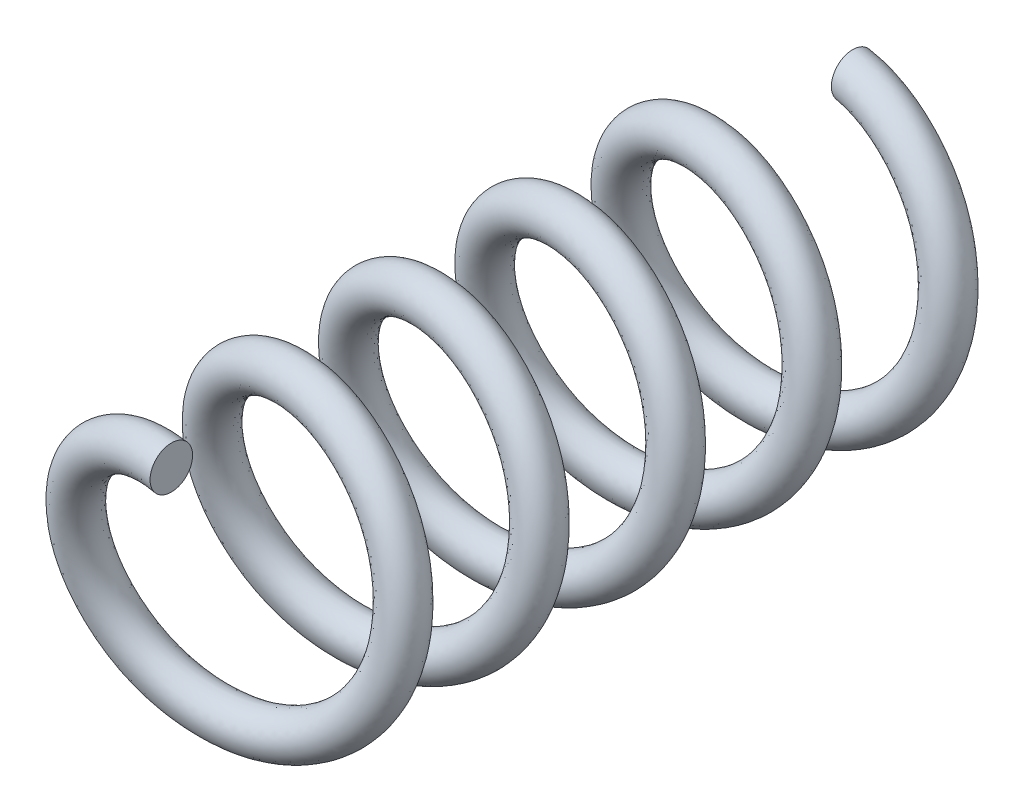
ISO-10303-21;
HEADER;
FILE_DESCRIPTION(('STEP AP214'),'2;1');
FILE_NAME('part.step','',(''),(''),'','','');
FILE_SCHEMA(('AUTOMOTIVE_DESIGN { 1 0 10303 214 1 1 1 1 }'));
ENDSEC;
DATA;
#1=APPLICATION_CONTEXT('core data for automotive mechanical design processes');
#2=APPLICATION_PROTOCOL_DEFINITION('international standard','automotive_design',2000,#1);
#3=PRODUCT_CONTEXT('',#1,'mechanical');
#4=PRODUCT('Part','Part','',(#3));
#5=PRODUCT_RELATED_PRODUCT_CATEGORY('part','',(#4));
#6=PRODUCT_DEFINITION_FORMATION('','',#4);
#7=PRODUCT_DEFINITION_CONTEXT('part definition',#1,'design');
#8=PRODUCT_DEFINITION('design','',#6,#7);
#9=PRODUCT_DEFINITION_SHAPE('','',#8);
#10=(LENGTH_UNIT() NAMED_UNIT(*) SI_UNIT(.MILLI.,.METRE.));
#11=(NAMED_UNIT(*) PLANE_ANGLE_UNIT() SI_UNIT($,.RADIAN.));
#12=(NAMED_UNIT(*) SI_UNIT($,.STERADIAN.) SOLID_ANGLE_UNIT());
#13=UNCERTAINTY_MEASURE_WITH_UNIT(LENGTH_MEASURE(1.E-05),#10,'distance_accuracy_value','');
#14=(GEOMETRIC_REPRESENTATION_CONTEXT(3) GLOBAL_UNCERTAINTY_ASSIGNED_CONTEXT((#13)) GLOBAL_UNIT_ASSIGNED_CONTEXT((#10,
#11,#12)) REPRESENTATION_CONTEXT('',''));
#15=CARTESIAN_POINT('',(0.,0.,0.));
#16=DIRECTION('',(0.,0.,1.));
#17=DIRECTION('',(1.,0.,0.));
#18=AXIS2_PLACEMENT_3D('',#15,#16,#17);
#19=CARTESIAN_POINT('',(0.,9.52499999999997,50.7999999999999));
#20=DIRECTION('',(1.,0.,0.));
#21=DIRECTION('',(0.,0.,-1.));
#22=AXIS2_PLACEMENT_3D('',#19,#20,#21);
#23=PLANE('',#22);
#24=CARTESIAN_POINT('',(5.72228425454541E-13,9.52499999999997,50.7999999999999));
#25=DIRECTION('',(1.,0.,0.));
#26=DIRECTION('',(0.,0.,-1.));
#27=AXIS2_PLACEMENT_3D('',#24,#25,#26);
#28=CIRCLE('',#27,1.5875);
#29=CARTESIAN_POINT('',(2.8611421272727E-13,9.52499999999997,49.2124999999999));
#30=VERTEX_POINT('',#29);
#31=EDGE_CURVE('E41',#30,#30,#28,.T.);
#32=ORIENTED_EDGE('',*,*,#31,.T.);
#33=EDGE_LOOP('',(#32));
#34=FACE_BOUND('',#33,.T.);
#35=ADVANCED_FACE('F31',(#34),#23,.T.);
#36=CARTESIAN_POINT('',(-1.23694015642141E-13,9.52499999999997,0.));
#37=DIRECTION('',(1.,0.,0.));
#38=DIRECTION('',(0.,0.,-1.));
#39=AXIS2_PLACEMENT_3D('',#36,#37,#38);
#40=PLANE('',#39);
#41=CARTESIAN_POINT('',(-1.23694015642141E-13,9.52499999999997,0.));
#42=DIRECTION('',(1.,0.,0.));
#43=DIRECTION('',(0.,0.,-1.));
#44=AXIS2_PLACEMENT_3D('',#41,#42,#43);
#45=CIRCLE('',#44,1.5875);
#46=CARTESIAN_POINT('',(-1.23694015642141E-13,9.52499999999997,-1.5875000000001));
#47=VERTEX_POINT('',#46);
#48=EDGE_CURVE('E11',#47,#47,#45,.T.);
#49=ORIENTED_EDGE('',*,*,#48,.F.);
#50=EDGE_LOOP('',(#49));
#51=FACE_BOUND('',#50,.T.);
#52=ADVANCED_FACE('F49',(#51),#40,.F.);
#53=CARTESIAN_POINT('',(5.72228425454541E-13,9.52499999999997,49.2124999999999));
#54=CARTESIAN_POINT('',(-3.94538418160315,9.52500000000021,48.5774999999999));
#55=CARTESIAN_POINT('',(-6.73519209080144,6.73519209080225,47.9424999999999));
#56=CARTESIAN_POINT('',(-9.52499999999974,3.94538418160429,47.3074999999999));
#57=CARTESIAN_POINT('',(-9.52499999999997,5.72811644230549E-13,46.6724999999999));
#58=CARTESIAN_POINT('',(-9.52500000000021,-3.94538418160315,46.0374999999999));
#59=CARTESIAN_POINT('',(-6.73519209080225,-6.73519209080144,45.4024999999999));
#60=CARTESIAN_POINT('',(-3.94538418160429,-9.52499999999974,44.7674999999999));
#61=CARTESIAN_POINT('',(-5.73394863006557E-13,-9.52499999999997,44.1324999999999));
#62=CARTESIAN_POINT('',(3.94538418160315,-9.52500000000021,43.4974999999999));
#63=CARTESIAN_POINT('',(6.73519209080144,-6.73519209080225,42.8624999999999));
#64=CARTESIAN_POINT('',(9.52499999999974,-3.9453841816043,42.2274999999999));
#65=CARTESIAN_POINT('',(9.52499999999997,-5.73978081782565E-13,41.5924999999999));
#66=CARTESIAN_POINT('',(9.52500000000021,3.94538418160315,40.9574999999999));
#67=CARTESIAN_POINT('',(6.73519209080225,6.73519209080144,40.3224999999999));
#68=CARTESIAN_POINT('',(3.9453841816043,9.52499999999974,39.6874999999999));
#69=CARTESIAN_POINT('',(5.72228425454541E-13,9.52499999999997,39.0524999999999));
#70=CARTESIAN_POINT('',(-3.94538418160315,9.52500000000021,38.4174999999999));
#71=CARTESIAN_POINT('',(-6.73519209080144,6.73519209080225,37.7824999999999));
#72=CARTESIAN_POINT('',(-9.52499999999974,3.94538418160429,37.1474999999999));
#73=CARTESIAN_POINT('',(-9.52499999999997,5.72811644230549E-13,36.5124999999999));
#74=CARTESIAN_POINT('',(-9.52500000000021,-3.94538418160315,35.8774999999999));
#75=CARTESIAN_POINT('',(-6.73519209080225,-6.73519209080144,35.2424999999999));
#76=CARTESIAN_POINT('',(-3.94538418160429,-9.52499999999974,34.6074999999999));
#77=CARTESIAN_POINT('',(-5.73394863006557E-13,-9.52499999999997,33.9724999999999));
#78=CARTESIAN_POINT('',(3.94538418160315,-9.52500000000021,33.3374999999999));
#79=CARTESIAN_POINT('',(6.73519209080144,-6.73519209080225,32.7024999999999));
#80=CARTESIAN_POINT('',(9.52499999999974,-3.9453841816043,32.0674999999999));
#81=CARTESIAN_POINT('',(9.52499999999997,-5.73978081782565E-13,31.4324999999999));
#82=CARTESIAN_POINT('',(9.52500000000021,3.94538418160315,30.7974999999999));
#83=CARTESIAN_POINT('',(6.73519209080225,6.73519209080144,30.1624999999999));
#84=CARTESIAN_POINT('',(3.9453841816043,9.52499999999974,29.5275));
#85=CARTESIAN_POINT('',(5.72228425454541E-13,9.52499999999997,28.8924999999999));
#86=CARTESIAN_POINT('',(-3.94538418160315,9.52500000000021,28.2575));
#87=CARTESIAN_POINT('',(-6.73519209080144,6.73519209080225,27.6225));
#88=CARTESIAN_POINT('',(-9.52499999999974,3.94538418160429,26.9875));
#89=CARTESIAN_POINT('',(-9.52499999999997,5.72811644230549E-13,26.3525));
#90=CARTESIAN_POINT('',(-9.52500000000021,-3.94538418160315,25.7175));
#91=CARTESIAN_POINT('',(-6.73519209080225,-6.73519209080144,25.0825));
#92=CARTESIAN_POINT('',(-3.94538418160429,-9.52499999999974,24.4475));
#93=CARTESIAN_POINT('',(-5.73394863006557E-13,-9.52499999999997,23.8125));
#94=CARTESIAN_POINT('',(3.94538418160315,-9.52500000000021,23.1775));
#95=CARTESIAN_POINT('',(6.73519209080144,-6.73519209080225,22.5425));
#96=CARTESIAN_POINT('',(9.52499999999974,-3.9453841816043,21.9075));
#97=CARTESIAN_POINT('',(9.52499999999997,-5.73978081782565E-13,21.2725));
#98=CARTESIAN_POINT('',(9.52500000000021,3.94538418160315,20.6375));
#99=CARTESIAN_POINT('',(6.73519209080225,6.73519209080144,20.0025));
#100=CARTESIAN_POINT('',(3.9453841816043,9.52499999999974,19.3675));
#101=CARTESIAN_POINT('',(5.72228425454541E-13,9.52499999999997,18.7325));
#102=CARTESIAN_POINT('',(-3.94538418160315,9.52500000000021,18.0975));
#103=CARTESIAN_POINT('',(-6.73519209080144,6.73519209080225,17.4625));
#104=CARTESIAN_POINT('',(-9.52499999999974,3.94538418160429,16.8275));
#105=CARTESIAN_POINT('',(-9.52499999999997,5.72811644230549E-13,16.1925));
#106=CARTESIAN_POINT('',(-9.52500000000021,-3.94538418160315,15.5575));
#107=CARTESIAN_POINT('',(-6.73519209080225,-6.73519209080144,14.9225));
#108=CARTESIAN_POINT('',(-3.94538418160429,-9.52499999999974,14.2875));
#109=CARTESIAN_POINT('',(-5.73394863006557E-13,-9.52499999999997,13.6525));
#110=CARTESIAN_POINT('',(3.94538418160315,-9.52500000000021,13.0175));
#111=CARTESIAN_POINT('',(6.73519209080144,-6.73519209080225,12.3825));
#112=CARTESIAN_POINT('',(9.52499999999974,-3.9453841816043,11.7475));
#113=CARTESIAN_POINT('',(9.52499999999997,-5.73978081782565E-13,11.1125));
#114=CARTESIAN_POINT('',(9.52500000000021,3.94538418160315,10.4775));
#115=CARTESIAN_POINT('',(6.73519209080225,6.73519209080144,9.8425));
#116=CARTESIAN_POINT('',(3.9453841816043,9.52499999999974,9.20749999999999));
#117=CARTESIAN_POINT('',(5.72228425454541E-13,9.52499999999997,8.5725));
#118=CARTESIAN_POINT('',(-3.94538418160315,9.52500000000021,7.9375));
#119=CARTESIAN_POINT('',(-6.73519209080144,6.73519209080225,7.3025));
#120=CARTESIAN_POINT('',(-9.52499999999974,3.94538418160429,6.6675));
#121=CARTESIAN_POINT('',(-9.52499999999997,5.72811644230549E-13,6.0325));
#122=CARTESIAN_POINT('',(-9.52500000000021,-3.94538418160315,5.39750000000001));
#123=CARTESIAN_POINT('',(-6.73519209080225,-6.73519209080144,4.7625));
#124=CARTESIAN_POINT('',(-3.94538418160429,-9.52499999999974,4.12750000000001));
#125=CARTESIAN_POINT('',(-5.73394863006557E-13,-9.52499999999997,3.49250000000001));
#126=CARTESIAN_POINT('',(3.94538418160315,-9.52500000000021,2.85750000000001));
#127=CARTESIAN_POINT('',(6.73519209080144,-6.73519209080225,2.22250000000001));
#128=CARTESIAN_POINT('',(9.52499999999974,-3.9453841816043,1.58750000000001));
#129=CARTESIAN_POINT('',(9.52499999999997,-5.73978081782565E-13,0.952500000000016));
#130=CARTESIAN_POINT('',(9.52500000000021,3.94538418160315,0.317500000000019));
#131=CARTESIAN_POINT('',(6.73519209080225,6.73519209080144,-0.317499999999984));
#132=CARTESIAN_POINT('',(3.9453841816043,9.52499999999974,-0.952499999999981));
#133=CARTESIAN_POINT('',(5.72228425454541E-13,9.52499999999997,-1.58749999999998));
#134=CARTESIAN_POINT('',(7.62971233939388E-13,12.7,49.2124999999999));
#135=CARTESIAN_POINT('',(-5.26051224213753,12.7000000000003,48.5774999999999));
#136=CARTESIAN_POINT('',(-8.98025612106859,8.98025612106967,47.9424999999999));
#137=CARTESIAN_POINT('',(-12.6999999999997,5.26051224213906,47.3074999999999));
#138=CARTESIAN_POINT('',(-12.7,7.63748858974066E-13,46.6724999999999));
#139=CARTESIAN_POINT('',(-12.7000000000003,-5.26051224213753,46.0374999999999));
#140=CARTESIAN_POINT('',(-8.98025612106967,-8.98025612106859,45.4024999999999));
#141=CARTESIAN_POINT('',(-5.26051224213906,-12.6999999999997,44.7674999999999));
#142=CARTESIAN_POINT('',(-7.64526484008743E-13,-12.7,44.1324999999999));
#143=CARTESIAN_POINT('',(5.26051224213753,-12.7000000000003,43.4974999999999));
#144=CARTESIAN_POINT('',(8.98025612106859,-8.98025612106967,42.8624999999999));
#145=CARTESIAN_POINT('',(12.6999999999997,-5.26051224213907,42.2274999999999));
#146=CARTESIAN_POINT('',(12.7,-7.6530410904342E-13,41.5924999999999));
#147=CARTESIAN_POINT('',(12.7000000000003,5.26051224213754,40.9574999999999));
#148=CARTESIAN_POINT('',(8.98025612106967,8.98025612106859,40.3224999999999));
#149=CARTESIAN_POINT('',(5.26051224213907,12.6999999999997,39.6874999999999));
#150=CARTESIAN_POINT('',(7.62971233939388E-13,12.7,39.0524999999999));
#151=CARTESIAN_POINT('',(-5.26051224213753,12.7000000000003,38.4174999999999));
#152=CARTESIAN_POINT('',(-8.98025612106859,8.98025612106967,37.7824999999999));
#153=CARTESIAN_POINT('',(-12.6999999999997,5.26051224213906,37.1474999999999));
#154=CARTESIAN_POINT('',(-12.7,7.63748858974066E-13,36.5124999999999));
#155=CARTESIAN_POINT('',(-12.7000000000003,-5.26051224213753,35.8774999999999));
#156=CARTESIAN_POINT('',(-8.98025612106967,-8.98025612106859,35.2424999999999));
#157=CARTESIAN_POINT('',(-5.26051224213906,-12.6999999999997,34.6074999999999));
#158=CARTESIAN_POINT('',(-7.64526484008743E-13,-12.7,33.9724999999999));
#159=CARTESIAN_POINT('',(5.26051224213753,-12.7000000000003,33.3374999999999));
#160=CARTESIAN_POINT('',(8.98025612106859,-8.98025612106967,32.7024999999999));
#161=CARTESIAN_POINT('',(12.6999999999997,-5.26051224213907,32.0674999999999));
#162=CARTESIAN_POINT('',(12.7,-7.6530410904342E-13,31.4324999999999));
#163=CARTESIAN_POINT('',(12.7000000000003,5.26051224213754,30.7974999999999));
#164=CARTESIAN_POINT('',(8.98025612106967,8.98025612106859,30.1624999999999));
#165=CARTESIAN_POINT('',(5.26051224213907,12.6999999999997,29.5275));
#166=CARTESIAN_POINT('',(7.62971233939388E-13,12.7,28.8924999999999));
#167=CARTESIAN_POINT('',(-5.26051224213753,12.7000000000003,28.2574999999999));
#168=CARTESIAN_POINT('',(-8.98025612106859,8.98025612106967,27.6225));
#169=CARTESIAN_POINT('',(-12.6999999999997,5.26051224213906,26.9875));
#170=CARTESIAN_POINT('',(-12.7,7.63748858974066E-13,26.3525));
#171=CARTESIAN_POINT('',(-12.7000000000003,-5.26051224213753,25.7175));
#172=CARTESIAN_POINT('',(-8.98025612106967,-8.98025612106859,25.0825));
#173=CARTESIAN_POINT('',(-5.26051224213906,-12.6999999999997,24.4475));
#174=CARTESIAN_POINT('',(-7.64526484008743E-13,-12.7,23.8125));
#175=CARTESIAN_POINT('',(5.26051224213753,-12.7000000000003,23.1775));
#176=CARTESIAN_POINT('',(8.98025612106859,-8.98025612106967,22.5425));
#177=CARTESIAN_POINT('',(12.6999999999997,-5.26051224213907,21.9075));
#178=CARTESIAN_POINT('',(12.7,-7.6530410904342E-13,21.2725));
#179=CARTESIAN_POINT('',(12.7000000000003,5.26051224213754,20.6375));
#180=CARTESIAN_POINT('',(8.98025612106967,8.98025612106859,20.0025));
#181=CARTESIAN_POINT('',(5.26051224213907,12.6999999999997,19.3675));
#182=CARTESIAN_POINT('',(7.62971233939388E-13,12.7,18.7325));
#183=CARTESIAN_POINT('',(-5.26051224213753,12.7000000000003,18.0975));
#184=CARTESIAN_POINT('',(-8.98025612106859,8.98025612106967,17.4625));
#185=CARTESIAN_POINT('',(-12.6999999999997,5.26051224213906,16.8275));
#186=CARTESIAN_POINT('',(-12.7,7.63748858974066E-13,16.1925));
#187=CARTESIAN_POINT('',(-12.7000000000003,-5.26051224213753,15.5575));
#188=CARTESIAN_POINT('',(-8.98025612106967,-8.98025612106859,14.9225));
#189=CARTESIAN_POINT('',(-5.26051224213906,-12.6999999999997,14.2875));
#190=CARTESIAN_POINT('',(-7.64526484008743E-13,-12.7,13.6525));
#191=CARTESIAN_POINT('',(5.26051224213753,-12.7000000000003,13.0175));
#192=CARTESIAN_POINT('',(8.98025612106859,-8.98025612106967,12.3825));
#193=CARTESIAN_POINT('',(12.6999999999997,-5.26051224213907,11.7475));
#194=CARTESIAN_POINT('',(12.7,-7.6530410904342E-13,11.1125));
#195=CARTESIAN_POINT('',(12.7000000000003,5.26051224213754,10.4775));
#196=CARTESIAN_POINT('',(8.98025612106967,8.98025612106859,9.8425));
#197=CARTESIAN_POINT('',(5.26051224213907,12.6999999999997,9.20749999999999));
#198=CARTESIAN_POINT('',(7.62971233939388E-13,12.7,8.5725));
#199=CARTESIAN_POINT('',(-5.26051224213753,12.7000000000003,7.9375));
#200=CARTESIAN_POINT('',(-8.98025612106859,8.98025612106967,7.3025));
#201=CARTESIAN_POINT('',(-12.6999999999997,5.26051224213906,6.6675));
#202=CARTESIAN_POINT('',(-12.7,7.63748858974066E-13,6.0325));
#203=CARTESIAN_POINT('',(-12.7000000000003,-5.26051224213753,5.39750000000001));
#204=CARTESIAN_POINT('',(-8.98025612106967,-8.98025612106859,4.7625));
#205=CARTESIAN_POINT('',(-5.26051224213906,-12.6999999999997,4.12750000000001));
#206=CARTESIAN_POINT('',(-7.64526484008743E-13,-12.7,3.49250000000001));
#207=CARTESIAN_POINT('',(5.26051224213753,-12.7000000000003,2.85750000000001));
#208=CARTESIAN_POINT('',(8.98025612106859,-8.98025612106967,2.22250000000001));
#209=CARTESIAN_POINT('',(12.6999999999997,-5.26051224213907,1.58750000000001));
#210=CARTESIAN_POINT('',(12.7,-7.6530410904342E-13,0.952500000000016));
#211=CARTESIAN_POINT('',(12.7000000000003,5.26051224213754,0.317500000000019));
#212=CARTESIAN_POINT('',(8.98025612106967,8.98025612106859,-0.317499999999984));
#213=CARTESIAN_POINT('',(5.26051224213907,12.6999999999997,-0.952499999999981));
#214=CARTESIAN_POINT('',(7.62971233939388E-13,12.7,-1.58749999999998));
#215=CARTESIAN_POINT('',(7.62971233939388E-13,12.7,52.3874999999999));
#216=CARTESIAN_POINT('',(-5.26051224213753,12.7000000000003,51.7524999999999));
#217=CARTESIAN_POINT('',(-8.98025612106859,8.98025612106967,51.1174999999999));
#218=CARTESIAN_POINT('',(-12.6999999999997,5.26051224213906,50.4824999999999));
#219=CARTESIAN_POINT('',(-12.7,7.63748858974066E-13,49.8474999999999));
#220=CARTESIAN_POINT('',(-12.7000000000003,-5.26051224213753,49.2124999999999));
#221=CARTESIAN_POINT('',(-8.98025612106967,-8.98025612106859,48.5774999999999));
#222=CARTESIAN_POINT('',(-5.26051224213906,-12.6999999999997,47.9424999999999));
#223=CARTESIAN_POINT('',(-7.64526484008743E-13,-12.7,47.3074999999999));
#224=CARTESIAN_POINT('',(5.26051224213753,-12.7000000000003,46.6724999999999));
#225=CARTESIAN_POINT('',(8.98025612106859,-8.98025612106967,46.0374999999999));
#226=CARTESIAN_POINT('',(12.6999999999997,-5.26051224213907,45.4024999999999));
#227=CARTESIAN_POINT('',(12.7,-7.6530410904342E-13,44.7674999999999));
#228=CARTESIAN_POINT('',(12.7000000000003,5.26051224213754,44.1324999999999));
#229=CARTESIAN_POINT('',(8.98025612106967,8.98025612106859,43.4974999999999));
#230=CARTESIAN_POINT('',(5.26051224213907,12.6999999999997,42.8624999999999));
#231=CARTESIAN_POINT('',(7.62971233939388E-13,12.7,42.2274999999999));
#232=CARTESIAN_POINT('',(-5.26051224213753,12.7000000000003,41.5924999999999));
#233=CARTESIAN_POINT('',(-8.98025612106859,8.98025612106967,40.9574999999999));
#234=CARTESIAN_POINT('',(-12.6999999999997,5.26051224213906,40.3224999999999));
#235=CARTESIAN_POINT('',(-12.7,7.63748858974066E-13,39.6874999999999));
#236=CARTESIAN_POINT('',(-12.7000000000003,-5.26051224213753,39.0524999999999));
#237=CARTESIAN_POINT('',(-8.98025612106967,-8.98025612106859,38.4174999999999));
#238=CARTESIAN_POINT('',(-5.26051224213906,-12.6999999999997,37.7824999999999));
#239=CARTESIAN_POINT('',(-7.64526484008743E-13,-12.7,37.1474999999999));
#240=CARTESIAN_POINT('',(5.26051224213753,-12.7000000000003,36.5124999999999));
#241=CARTESIAN_POINT('',(8.98025612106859,-8.98025612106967,35.8774999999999));
#242=CARTESIAN_POINT('',(12.6999999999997,-5.26051224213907,35.2424999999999));
#243=CARTESIAN_POINT('',(12.7,-7.6530410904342E-13,34.6074999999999));
#244=CARTESIAN_POINT('',(12.7000000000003,5.26051224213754,33.9724999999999));
#245=CARTESIAN_POINT('',(8.98025612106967,8.98025612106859,33.3374999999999));
#246=CARTESIAN_POINT('',(5.26051224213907,12.6999999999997,32.7024999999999));
#247=CARTESIAN_POINT('',(7.62971233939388E-13,12.7,32.0674999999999));
#248=CARTESIAN_POINT('',(-5.26051224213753,12.7000000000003,31.4324999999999));
#249=CARTESIAN_POINT('',(-8.98025612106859,8.98025612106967,30.7974999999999));
#250=CARTESIAN_POINT('',(-12.6999999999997,5.26051224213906,30.1624999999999));
#251=CARTESIAN_POINT('',(-12.7,7.63748858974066E-13,29.5274999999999));
#252=CARTESIAN_POINT('',(-12.7000000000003,-5.26051224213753,28.8924999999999));
#253=CARTESIAN_POINT('',(-8.98025612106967,-8.98025612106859,28.2575));
#254=CARTESIAN_POINT('',(-5.26051224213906,-12.6999999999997,27.6225));
#255=CARTESIAN_POINT('',(-7.64526484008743E-13,-12.7,26.9875));
#256=CARTESIAN_POINT('',(5.26051224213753,-12.7000000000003,26.3525));
#257=CARTESIAN_POINT('',(8.98025612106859,-8.98025612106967,25.7175));
#258=CARTESIAN_POINT('',(12.6999999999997,-5.26051224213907,25.0825));
#259=CARTESIAN_POINT('',(12.7,-7.6530410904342E-13,24.4475));
#260=CARTESIAN_POINT('',(12.7000000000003,5.26051224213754,23.8125));
#261=CARTESIAN_POINT('',(8.98025612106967,8.98025612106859,23.1775));
#262=CARTESIAN_POINT('',(5.26051224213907,12.6999999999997,22.5425));
#263=CARTESIAN_POINT('',(7.62971233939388E-13,12.7,21.9075));
#264=CARTESIAN_POINT('',(-5.26051224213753,12.7000000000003,21.2725));
#265=CARTESIAN_POINT('',(-8.98025612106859,8.98025612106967,20.6375));
#266=CARTESIAN_POINT('',(-12.6999999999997,5.26051224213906,20.0025));
#267=CARTESIAN_POINT('',(-12.7,7.63748858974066E-13,19.3675));
#268=CARTESIAN_POINT('',(-12.7000000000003,-5.26051224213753,18.7325));
#269=CARTESIAN_POINT('',(-8.98025612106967,-8.98025612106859,18.0975));
#270=CARTESIAN_POINT('',(-5.26051224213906,-12.6999999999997,17.4625));
#271=CARTESIAN_POINT('',(-7.64526484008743E-13,-12.7,16.8275));
#272=CARTESIAN_POINT('',(5.26051224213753,-12.7000000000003,16.1925));
#273=CARTESIAN_POINT('',(8.98025612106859,-8.98025612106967,15.5575));
#274=CARTESIAN_POINT('',(12.6999999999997,-5.26051224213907,14.9225));
#275=CARTESIAN_POINT('',(12.7,-7.6530410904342E-13,14.2875));
#276=CARTESIAN_POINT('',(12.7000000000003,5.26051224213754,13.6525));
#277=CARTESIAN_POINT('',(8.98025612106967,8.98025612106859,13.0175));
#278=CARTESIAN_POINT('',(5.26051224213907,12.6999999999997,12.3825));
#279=CARTESIAN_POINT('',(7.62971233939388E-13,12.7,11.7475));
#280=CARTESIAN_POINT('',(-5.26051224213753,12.7000000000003,11.1125));
#281=CARTESIAN_POINT('',(-8.98025612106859,8.98025612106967,10.4775));
#282=CARTESIAN_POINT('',(-12.6999999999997,5.26051224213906,9.84249999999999));
#283=CARTESIAN_POINT('',(-12.7,7.63748858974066E-13,9.20749999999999));
#284=CARTESIAN_POINT('',(-12.7000000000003,-5.26051224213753,8.5725));
#285=CARTESIAN_POINT('',(-8.98025612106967,-8.98025612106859,7.93749999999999));
#286=CARTESIAN_POINT('',(-5.26051224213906,-12.6999999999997,7.3025));
#287=CARTESIAN_POINT('',(-7.64526484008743E-13,-12.7,6.6675));
#288=CARTESIAN_POINT('',(5.26051224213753,-12.7000000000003,6.0325));
#289=CARTESIAN_POINT('',(8.98025612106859,-8.98025612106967,5.3975));
#290=CARTESIAN_POINT('',(12.6999999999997,-5.26051224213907,4.7625));
#291=CARTESIAN_POINT('',(12.7,-7.6530410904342E-13,4.12750000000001));
#292=CARTESIAN_POINT('',(12.7000000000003,5.26051224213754,3.49250000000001));
#293=CARTESIAN_POINT('',(8.98025612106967,8.98025612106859,2.85750000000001));
#294=CARTESIAN_POINT('',(5.26051224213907,12.6999999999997,2.22250000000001));
#295=CARTESIAN_POINT('',(7.62971233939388E-13,12.7,1.58750000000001));
#296=CARTESIAN_POINT('',(5.72228425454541E-13,9.52499999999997,52.3874999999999));
#297=CARTESIAN_POINT('',(-3.94538418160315,9.52500000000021,51.7524999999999));
#298=CARTESIAN_POINT('',(-6.73519209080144,6.73519209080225,51.1174999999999));
#299=CARTESIAN_POINT('',(-9.52499999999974,3.94538418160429,50.4824999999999));
#300=CARTESIAN_POINT('',(-9.52499999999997,5.72811644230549E-13,49.8474999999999));
#301=CARTESIAN_POINT('',(-9.52500000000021,-3.94538418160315,49.2124999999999));
#302=CARTESIAN_POINT('',(-6.73519209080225,-6.73519209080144,48.5774999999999));
#303=CARTESIAN_POINT('',(-3.94538418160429,-9.52499999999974,47.9424999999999));
#304=CARTESIAN_POINT('',(-5.73394863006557E-13,-9.52499999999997,47.3074999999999));
#305=CARTESIAN_POINT('',(3.94538418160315,-9.52500000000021,46.6724999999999));
#306=CARTESIAN_POINT('',(6.73519209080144,-6.73519209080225,46.0374999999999));
#307=CARTESIAN_POINT('',(9.52499999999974,-3.9453841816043,45.4024999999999));
#308=CARTESIAN_POINT('',(9.52499999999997,-5.73978081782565E-13,44.7674999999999));
#309=CARTESIAN_POINT('',(9.52500000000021,3.94538418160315,44.1324999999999));
#310=CARTESIAN_POINT('',(6.73519209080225,6.73519209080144,43.4974999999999));
#311=CARTESIAN_POINT('',(3.9453841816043,9.52499999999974,42.8624999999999));
#312=CARTESIAN_POINT('',(5.72228425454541E-13,9.52499999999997,42.2274999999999));
#313=CARTESIAN_POINT('',(-3.94538418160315,9.52500000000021,41.5924999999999));
#314=CARTESIAN_POINT('',(-6.73519209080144,6.73519209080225,40.9574999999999));
#315=CARTESIAN_POINT('',(-9.52499999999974,3.94538418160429,40.3224999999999));
#316=CARTESIAN_POINT('',(-9.52499999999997,5.72811644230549E-13,39.6874999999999));
#317=CARTESIAN_POINT('',(-9.52500000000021,-3.94538418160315,39.0524999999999));
#318=CARTESIAN_POINT('',(-6.73519209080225,-6.73519209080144,38.4174999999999));
#319=CARTESIAN_POINT('',(-3.94538418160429,-9.52499999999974,37.7824999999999));
#320=CARTESIAN_POINT('',(-5.73394863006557E-13,-9.52499999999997,37.1474999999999));
#321=CARTESIAN_POINT('',(3.94538418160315,-9.52500000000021,36.5124999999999));
#322=CARTESIAN_POINT('',(6.73519209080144,-6.73519209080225,35.8774999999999));
#323=CARTESIAN_POINT('',(9.52499999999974,-3.9453841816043,35.2424999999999));
#324=CARTESIAN_POINT('',(9.52499999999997,-5.73978081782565E-13,34.6074999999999));
#325=CARTESIAN_POINT('',(9.52500000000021,3.94538418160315,33.9724999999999));
#326=CARTESIAN_POINT('',(6.73519209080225,6.73519209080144,33.3374999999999));
#327=CARTESIAN_POINT('',(3.9453841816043,9.52499999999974,32.7024999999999));
#328=CARTESIAN_POINT('',(5.72228425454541E-13,9.52499999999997,32.0674999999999));
#329=CARTESIAN_POINT('',(-3.94538418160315,9.52500000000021,31.4324999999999));
#330=CARTESIAN_POINT('',(-6.73519209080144,6.73519209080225,30.7974999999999));
#331=CARTESIAN_POINT('',(-9.52499999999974,3.94538418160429,30.1624999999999));
#332=CARTESIAN_POINT('',(-9.52499999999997,5.72811644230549E-13,29.5275));
#333=CARTESIAN_POINT('',(-9.52500000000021,-3.94538418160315,28.8925));
#334=CARTESIAN_POINT('',(-6.73519209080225,-6.73519209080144,28.2575));
#335=CARTESIAN_POINT('',(-3.94538418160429,-9.52499999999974,27.6225));
#336=CARTESIAN_POINT('',(-5.73394863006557E-13,-9.52499999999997,26.9875));
#337=CARTESIAN_POINT('',(3.94538418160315,-9.52500000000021,26.3525));
#338=CARTESIAN_POINT('',(6.73519209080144,-6.73519209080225,25.7175));
#339=CARTESIAN_POINT('',(9.52499999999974,-3.9453841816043,25.0825));
#340=CARTESIAN_POINT('',(9.52499999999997,-5.73978081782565E-13,24.4475));
#341=CARTESIAN_POINT('',(9.52500000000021,3.94538418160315,23.8125));
#342=CARTESIAN_POINT('',(6.73519209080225,6.73519209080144,23.1775));
#343=CARTESIAN_POINT('',(3.9453841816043,9.52499999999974,22.5425));
#344=CARTESIAN_POINT('',(5.72228425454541E-13,9.52499999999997,21.9075));
#345=CARTESIAN_POINT('',(-3.94538418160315,9.52500000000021,21.2725));
#346=CARTESIAN_POINT('',(-6.73519209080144,6.73519209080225,20.6375));
#347=CARTESIAN_POINT('',(-9.52499999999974,3.94538418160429,20.0025));
#348=CARTESIAN_POINT('',(-9.52499999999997,5.72811644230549E-13,19.3675));
#349=CARTESIAN_POINT('',(-9.52500000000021,-3.94538418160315,18.7325));
#350=CARTESIAN_POINT('',(-6.73519209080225,-6.73519209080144,18.0975));
#351=CARTESIAN_POINT('',(-3.94538418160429,-9.52499999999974,17.4625));
#352=CARTESIAN_POINT('',(-5.73394863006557E-13,-9.52499999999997,16.8275));
#353=CARTESIAN_POINT('',(3.94538418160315,-9.52500000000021,16.1925));
#354=CARTESIAN_POINT('',(6.73519209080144,-6.73519209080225,15.5575));
#355=CARTESIAN_POINT('',(9.52499999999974,-3.9453841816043,14.9225));
#356=CARTESIAN_POINT('',(9.52499999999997,-5.73978081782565E-13,14.2875));
#357=CARTESIAN_POINT('',(9.52500000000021,3.94538418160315,13.6525));
#358=CARTESIAN_POINT('',(6.73519209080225,6.73519209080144,13.0175));
#359=CARTESIAN_POINT('',(3.9453841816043,9.52499999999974,12.3825));
#360=CARTESIAN_POINT('',(5.72228425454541E-13,9.52499999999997,11.7475));
#361=CARTESIAN_POINT('',(-3.94538418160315,9.52500000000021,11.1125));
#362=CARTESIAN_POINT('',(-6.73519209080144,6.73519209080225,10.4775));
#363=CARTESIAN_POINT('',(-9.52499999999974,3.94538418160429,9.8425));
#364=CARTESIAN_POINT('',(-9.52499999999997,5.72811644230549E-13,9.2075));
#365=CARTESIAN_POINT('',(-9.52500000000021,-3.94538418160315,8.5725));
#366=CARTESIAN_POINT('',(-6.73519209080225,-6.73519209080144,7.9375));
#367=CARTESIAN_POINT('',(-3.94538418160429,-9.52499999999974,7.3025));
#368=CARTESIAN_POINT('',(-5.73394863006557E-13,-9.52499999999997,6.66750000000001));
#369=CARTESIAN_POINT('',(3.94538418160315,-9.52500000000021,6.03250000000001));
#370=CARTESIAN_POINT('',(6.73519209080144,-6.73519209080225,5.39750000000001));
#371=CARTESIAN_POINT('',(9.52499999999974,-3.9453841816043,4.76250000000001));
#372=CARTESIAN_POINT('',(9.52499999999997,-5.73978081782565E-13,4.12750000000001));
#373=CARTESIAN_POINT('',(9.52500000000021,3.94538418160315,3.49250000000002));
#374=CARTESIAN_POINT('',(6.73519209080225,6.73519209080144,2.85750000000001));
#375=CARTESIAN_POINT('',(3.9453841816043,9.52499999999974,2.22250000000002));
#376=CARTESIAN_POINT('',(5.72228425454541E-13,9.52499999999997,1.58750000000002));
#377=CARTESIAN_POINT('',(3.81485616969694E-13,6.34999999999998,52.3874999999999));
#378=CARTESIAN_POINT('',(-2.63025612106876,6.35000000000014,51.7524999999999));
#379=CARTESIAN_POINT('',(-4.49012806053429,4.49012806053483,51.1174999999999));
#380=CARTESIAN_POINT('',(-6.34999999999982,2.63025612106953,50.4824999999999));
#381=CARTESIAN_POINT('',(-6.34999999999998,3.81874429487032E-13,49.8474999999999));
#382=CARTESIAN_POINT('',(-6.35000000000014,-2.63025612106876,49.2124999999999));
#383=CARTESIAN_POINT('',(-4.49012806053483,-4.49012806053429,48.5774999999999));
#384=CARTESIAN_POINT('',(-2.63025612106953,-6.34999999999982,47.9424999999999));
#385=CARTESIAN_POINT('',(-3.82263242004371E-13,-6.34999999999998,47.3074999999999));
#386=CARTESIAN_POINT('',(2.63025612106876,-6.35000000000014,46.6724999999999));
#387=CARTESIAN_POINT('',(4.49012806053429,-4.49012806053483,46.0374999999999));
#388=CARTESIAN_POINT('',(6.34999999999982,-2.63025612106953,45.4024999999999));
#389=CARTESIAN_POINT('',(6.34999999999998,-3.82652054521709E-13,44.7674999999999));
#390=CARTESIAN_POINT('',(6.35000000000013,2.63025612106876,44.1324999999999));
#391=CARTESIAN_POINT('',(4.49012806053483,4.49012806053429,43.4974999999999));
#392=CARTESIAN_POINT('',(2.63025612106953,6.34999999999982,42.8624999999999));
#393=CARTESIAN_POINT('',(3.81485616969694E-13,6.34999999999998,42.2274999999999));
#394=CARTESIAN_POINT('',(-2.63025612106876,6.35000000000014,41.5924999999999));
#395=CARTESIAN_POINT('',(-4.49012806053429,4.49012806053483,40.9574999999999));
#396=CARTESIAN_POINT('',(-6.34999999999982,2.63025612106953,40.3224999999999));
#397=CARTESIAN_POINT('',(-6.34999999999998,3.81874429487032E-13,39.6874999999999));
#398=CARTESIAN_POINT('',(-6.35000000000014,-2.63025612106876,39.0524999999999));
#399=CARTESIAN_POINT('',(-4.49012806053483,-4.49012806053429,38.4174999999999));
#400=CARTESIAN_POINT('',(-2.63025612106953,-6.34999999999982,37.7824999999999));
#401=CARTESIAN_POINT('',(-3.82263242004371E-13,-6.34999999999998,37.1474999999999));
#402=CARTESIAN_POINT('',(2.63025612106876,-6.35000000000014,36.5124999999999));
#403=CARTESIAN_POINT('',(4.49012806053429,-4.49012806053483,35.8774999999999));
#404=CARTESIAN_POINT('',(6.34999999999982,-2.63025612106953,35.2424999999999));
#405=CARTESIAN_POINT('',(6.34999999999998,-3.82652054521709E-13,34.6074999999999));
#406=CARTESIAN_POINT('',(6.35000000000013,2.63025612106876,33.9724999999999));
#407=CARTESIAN_POINT('',(4.49012806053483,4.49012806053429,33.3374999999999));
#408=CARTESIAN_POINT('',(2.63025612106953,6.34999999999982,32.7024999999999));
#409=CARTESIAN_POINT('',(3.81485616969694E-13,6.34999999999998,32.0674999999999));
#410=CARTESIAN_POINT('',(-2.63025612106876,6.35000000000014,31.4324999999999));
#411=CARTESIAN_POINT('',(-4.49012806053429,4.49012806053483,30.7974999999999));
#412=CARTESIAN_POINT('',(-6.34999999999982,2.63025612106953,30.1624999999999));
#413=CARTESIAN_POINT('',(-6.34999999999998,3.81874429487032E-13,29.5274999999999));
#414=CARTESIAN_POINT('',(-6.35000000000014,-2.63025612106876,28.8924999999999));
#415=CARTESIAN_POINT('',(-4.49012806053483,-4.49012806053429,28.2575));
#416=CARTESIAN_POINT('',(-2.63025612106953,-6.34999999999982,27.6225));
#417=CARTESIAN_POINT('',(-3.82263242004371E-13,-6.34999999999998,26.9875));
#418=CARTESIAN_POINT('',(2.63025612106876,-6.35000000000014,26.3525));
#419=CARTESIAN_POINT('',(4.49012806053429,-4.49012806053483,25.7175));
#420=CARTESIAN_POINT('',(6.34999999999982,-2.63025612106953,25.0825));
#421=CARTESIAN_POINT('',(6.34999999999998,-3.82652054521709E-13,24.4475));
#422=CARTESIAN_POINT('',(6.35000000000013,2.63025612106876,23.8125));
#423=CARTESIAN_POINT('',(4.49012806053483,4.49012806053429,23.1775));
#424=CARTESIAN_POINT('',(2.63025612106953,6.34999999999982,22.5425));
#425=CARTESIAN_POINT('',(3.81485616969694E-13,6.34999999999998,21.9075));
#426=CARTESIAN_POINT('',(-2.63025612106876,6.35000000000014,21.2725));
#427=CARTESIAN_POINT('',(-4.49012806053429,4.49012806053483,20.6375));
#428=CARTESIAN_POINT('',(-6.34999999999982,2.63025612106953,20.0025));
#429=CARTESIAN_POINT('',(-6.34999999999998,3.81874429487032E-13,19.3675));
#430=CARTESIAN_POINT('',(-6.35000000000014,-2.63025612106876,18.7325));
#431=CARTESIAN_POINT('',(-4.49012806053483,-4.49012806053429,18.0975));
#432=CARTESIAN_POINT('',(-2.63025612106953,-6.34999999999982,17.4625));
#433=CARTESIAN_POINT('',(-3.82263242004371E-13,-6.34999999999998,16.8275));
#434=CARTESIAN_POINT('',(2.63025612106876,-6.35000000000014,16.1925));
#435=CARTESIAN_POINT('',(4.49012806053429,-4.49012806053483,15.5575));
#436=CARTESIAN_POINT('',(6.34999999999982,-2.63025612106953,14.9225));
#437=CARTESIAN_POINT('',(6.34999999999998,-3.82652054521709E-13,14.2875));
#438=CARTESIAN_POINT('',(6.35000000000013,2.63025612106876,13.6525));
#439=CARTESIAN_POINT('',(4.49012806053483,4.49012806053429,13.0175));
#440=CARTESIAN_POINT('',(2.63025612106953,6.34999999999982,12.3825));
#441=CARTESIAN_POINT('',(3.81485616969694E-13,6.34999999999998,11.7475));
#442=CARTESIAN_POINT('',(-2.63025612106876,6.35000000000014,11.1125));
#443=CARTESIAN_POINT('',(-4.49012806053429,4.49012806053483,10.4775));
#444=CARTESIAN_POINT('',(-6.34999999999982,2.63025612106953,9.84249999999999));
#445=CARTESIAN_POINT('',(-6.34999999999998,3.81874429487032E-13,9.20749999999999));
#446=CARTESIAN_POINT('',(-6.35000000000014,-2.63025612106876,8.5725));
#447=CARTESIAN_POINT('',(-4.49012806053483,-4.49012806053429,7.93749999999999));
#448=CARTESIAN_POINT('',(-2.63025612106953,-6.34999999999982,7.3025));
#449=CARTESIAN_POINT('',(-3.82263242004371E-13,-6.34999999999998,6.6675));
#450=CARTESIAN_POINT('',(2.63025612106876,-6.35000000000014,6.0325));
#451=CARTESIAN_POINT('',(4.49012806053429,-4.49012806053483,5.3975));
#452=CARTESIAN_POINT('',(6.34999999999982,-2.63025612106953,4.7625));
#453=CARTESIAN_POINT('',(6.34999999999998,-3.82652054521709E-13,4.12750000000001));
#454=CARTESIAN_POINT('',(6.35000000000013,2.63025612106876,3.49250000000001));
#455=CARTESIAN_POINT('',(4.49012806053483,4.49012806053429,2.85750000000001));
#456=CARTESIAN_POINT('',(2.63025612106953,6.34999999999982,2.22250000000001));
#457=CARTESIAN_POINT('',(3.81485616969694E-13,6.34999999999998,1.58750000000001));
#458=CARTESIAN_POINT('',(3.81485616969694E-13,6.34999999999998,49.2124999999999));
#459=CARTESIAN_POINT('',(-2.63025612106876,6.35000000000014,48.5774999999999));
#460=CARTESIAN_POINT('',(-4.49012806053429,4.49012806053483,47.9424999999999));
#461=CARTESIAN_POINT('',(-6.34999999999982,2.63025612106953,47.3074999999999));
#462=CARTESIAN_POINT('',(-6.34999999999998,3.81874429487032E-13,46.6724999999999));
#463=CARTESIAN_POINT('',(-6.35000000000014,-2.63025612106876,46.0374999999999));
#464=CARTESIAN_POINT('',(-4.49012806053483,-4.49012806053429,45.4024999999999));
#465=CARTESIAN_POINT('',(-2.63025612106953,-6.34999999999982,44.7674999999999));
#466=CARTESIAN_POINT('',(-3.82263242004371E-13,-6.34999999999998,44.1324999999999));
#467=CARTESIAN_POINT('',(2.63025612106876,-6.35000000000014,43.4974999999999));
#468=CARTESIAN_POINT('',(4.49012806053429,-4.49012806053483,42.8624999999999));
#469=CARTESIAN_POINT('',(6.34999999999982,-2.63025612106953,42.2274999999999));
#470=CARTESIAN_POINT('',(6.34999999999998,-3.82652054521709E-13,41.5924999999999));
#471=CARTESIAN_POINT('',(6.35000000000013,2.63025612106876,40.9574999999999));
#472=CARTESIAN_POINT('',(4.49012806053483,4.49012806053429,40.3224999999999));
#473=CARTESIAN_POINT('',(2.63025612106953,6.34999999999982,39.6874999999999));
#474=CARTESIAN_POINT('',(3.81485616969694E-13,6.34999999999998,39.0524999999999));
#475=CARTESIAN_POINT('',(-2.63025612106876,6.35000000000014,38.4174999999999));
#476=CARTESIAN_POINT('',(-4.49012806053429,4.49012806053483,37.7824999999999));
#477=CARTESIAN_POINT('',(-6.34999999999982,2.63025612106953,37.1474999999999));
#478=CARTESIAN_POINT('',(-6.34999999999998,3.81874429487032E-13,36.5124999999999));
#479=CARTESIAN_POINT('',(-6.35000000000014,-2.63025612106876,35.8774999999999));
#480=CARTESIAN_POINT('',(-4.49012806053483,-4.49012806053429,35.2424999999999));
#481=CARTESIAN_POINT('',(-2.63025612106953,-6.34999999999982,34.6074999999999));
#482=CARTESIAN_POINT('',(-3.82263242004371E-13,-6.34999999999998,33.9724999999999));
#483=CARTESIAN_POINT('',(2.63025612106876,-6.35000000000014,33.3374999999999));
#484=CARTESIAN_POINT('',(4.49012806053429,-4.49012806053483,32.7024999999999));
#485=CARTESIAN_POINT('',(6.34999999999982,-2.63025612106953,32.0674999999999));
#486=CARTESIAN_POINT('',(6.34999999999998,-3.82652054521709E-13,31.4324999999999));
#487=CARTESIAN_POINT('',(6.35000000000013,2.63025612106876,30.7974999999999));
#488=CARTESIAN_POINT('',(4.49012806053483,4.49012806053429,30.1624999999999));
#489=CARTESIAN_POINT('',(2.63025612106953,6.34999999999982,29.5275));
#490=CARTESIAN_POINT('',(3.81485616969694E-13,6.34999999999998,28.8924999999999));
#491=CARTESIAN_POINT('',(-2.63025612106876,6.35000000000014,28.2574999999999));
#492=CARTESIAN_POINT('',(-4.49012806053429,4.49012806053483,27.6225));
#493=CARTESIAN_POINT('',(-6.34999999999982,2.63025612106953,26.9875));
#494=CARTESIAN_POINT('',(-6.34999999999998,3.81874429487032E-13,26.3525));
#495=CARTESIAN_POINT('',(-6.35000000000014,-2.63025612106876,25.7175));
#496=CARTESIAN_POINT('',(-4.49012806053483,-4.49012806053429,25.0825));
#497=CARTESIAN_POINT('',(-2.63025612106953,-6.34999999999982,24.4475));
#498=CARTESIAN_POINT('',(-3.82263242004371E-13,-6.34999999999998,23.8125));
#499=CARTESIAN_POINT('',(2.63025612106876,-6.35000000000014,23.1775));
#500=CARTESIAN_POINT('',(4.49012806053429,-4.49012806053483,22.5425));
#501=CARTESIAN_POINT('',(6.34999999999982,-2.63025612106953,21.9075));
#502=CARTESIAN_POINT('',(6.34999999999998,-3.82652054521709E-13,21.2725));
#503=CARTESIAN_POINT('',(6.35000000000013,2.63025612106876,20.6375));
#504=CARTESIAN_POINT('',(4.49012806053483,4.49012806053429,20.0025));
#505=CARTESIAN_POINT('',(2.63025612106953,6.34999999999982,19.3675));
#506=CARTESIAN_POINT('',(3.81485616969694E-13,6.34999999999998,18.7325));
#507=CARTESIAN_POINT('',(-2.63025612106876,6.35000000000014,18.0975));
#508=CARTESIAN_POINT('',(-4.49012806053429,4.49012806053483,17.4625));
#509=CARTESIAN_POINT('',(-6.34999999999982,2.63025612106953,16.8275));
#510=CARTESIAN_POINT('',(-6.34999999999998,3.81874429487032E-13,16.1925));
#511=CARTESIAN_POINT('',(-6.35000000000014,-2.63025612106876,15.5575));
#512=CARTESIAN_POINT('',(-4.49012806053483,-4.49012806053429,14.9225));
#513=CARTESIAN_POINT('',(-2.63025612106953,-6.34999999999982,14.2875));
#514=CARTESIAN_POINT('',(-3.82263242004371E-13,-6.34999999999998,13.6525));
#515=CARTESIAN_POINT('',(2.63025612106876,-6.35000000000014,13.0175));
#516=CARTESIAN_POINT('',(4.49012806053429,-4.49012806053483,12.3825));
#517=CARTESIAN_POINT('',(6.34999999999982,-2.63025612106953,11.7475));
#518=CARTESIAN_POINT('',(6.34999999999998,-3.82652054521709E-13,11.1125));
#519=CARTESIAN_POINT('',(6.35000000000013,2.63025612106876,10.4775));
#520=CARTESIAN_POINT('',(4.49012806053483,4.49012806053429,9.8425));
#521=CARTESIAN_POINT('',(2.63025612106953,6.34999999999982,9.20749999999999));
#522=CARTESIAN_POINT('',(3.81485616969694E-13,6.34999999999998,8.5725));
#523=CARTESIAN_POINT('',(-2.63025612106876,6.35000000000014,7.9375));
#524=CARTESIAN_POINT('',(-4.49012806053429,4.49012806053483,7.3025));
#525=CARTESIAN_POINT('',(-6.34999999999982,2.63025612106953,6.6675));
#526=CARTESIAN_POINT('',(-6.34999999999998,3.81874429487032E-13,6.0325));
#527=CARTESIAN_POINT('',(-6.35000000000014,-2.63025612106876,5.39750000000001));
#528=CARTESIAN_POINT('',(-4.49012806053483,-4.49012806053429,4.7625));
#529=CARTESIAN_POINT('',(-2.63025612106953,-6.34999999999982,4.12750000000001));
#530=CARTESIAN_POINT('',(-3.82263242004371E-13,-6.34999999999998,3.49250000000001));
#531=CARTESIAN_POINT('',(2.63025612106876,-6.35000000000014,2.85750000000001));
#532=CARTESIAN_POINT('',(4.49012806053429,-4.49012806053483,2.22250000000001));
#533=CARTESIAN_POINT('',(6.34999999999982,-2.63025612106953,1.58750000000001));
#534=CARTESIAN_POINT('',(6.34999999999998,-3.82652054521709E-13,0.952500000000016));
#535=CARTESIAN_POINT('',(6.35000000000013,2.63025612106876,0.317500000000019));
#536=CARTESIAN_POINT('',(4.49012806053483,4.49012806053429,-0.317499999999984));
#537=CARTESIAN_POINT('',(2.63025612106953,6.34999999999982,-0.952499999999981));
#538=CARTESIAN_POINT('',(3.81485616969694E-13,6.34999999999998,-1.58749999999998));
#539=CARTESIAN_POINT('',(5.72228425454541E-13,9.52499999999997,49.2124999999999));
#540=CARTESIAN_POINT('',(-3.94538418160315,9.52500000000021,48.5774999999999));
#541=CARTESIAN_POINT('',(-6.73519209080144,6.73519209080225,47.9424999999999));
#542=CARTESIAN_POINT('',(-9.52499999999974,3.94538418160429,47.3074999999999));
#543=CARTESIAN_POINT('',(-9.52499999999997,5.72811644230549E-13,46.6724999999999));
#544=CARTESIAN_POINT('',(-9.52500000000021,-3.94538418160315,46.0374999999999));
#545=CARTESIAN_POINT('',(-6.73519209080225,-6.73519209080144,45.4024999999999));
#546=CARTESIAN_POINT('',(-3.94538418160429,-9.52499999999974,44.7674999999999));
#547=CARTESIAN_POINT('',(-5.73394863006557E-13,-9.52499999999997,44.1324999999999));
#548=CARTESIAN_POINT('',(3.94538418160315,-9.52500000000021,43.4974999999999));
#549=CARTESIAN_POINT('',(6.73519209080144,-6.73519209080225,42.8624999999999));
#550=CARTESIAN_POINT('',(9.52499999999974,-3.9453841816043,42.2274999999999));
#551=CARTESIAN_POINT('',(9.52499999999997,-5.73978081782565E-13,41.5924999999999));
#552=CARTESIAN_POINT('',(9.52500000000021,3.94538418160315,40.9574999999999));
#553=CARTESIAN_POINT('',(6.73519209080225,6.73519209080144,40.3224999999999));
#554=CARTESIAN_POINT('',(3.9453841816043,9.52499999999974,39.6874999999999));
#555=CARTESIAN_POINT('',(5.72228425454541E-13,9.52499999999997,39.0524999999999));
#556=CARTESIAN_POINT('',(-3.94538418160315,9.52500000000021,38.4174999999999));
#557=CARTESIAN_POINT('',(-6.73519209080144,6.73519209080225,37.7824999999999));
#558=CARTESIAN_POINT('',(-9.52499999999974,3.94538418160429,37.1474999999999));
#559=CARTESIAN_POINT('',(-9.52499999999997,5.72811644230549E-13,36.5124999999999));
#560=CARTESIAN_POINT('',(-9.52500000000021,-3.94538418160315,35.8774999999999));
#561=CARTESIAN_POINT('',(-6.73519209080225,-6.73519209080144,35.2424999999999));
#562=CARTESIAN_POINT('',(-3.94538418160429,-9.52499999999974,34.6074999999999));
#563=CARTESIAN_POINT('',(-5.73394863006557E-13,-9.52499999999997,33.9724999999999));
#564=CARTESIAN_POINT('',(3.94538418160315,-9.52500000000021,33.3374999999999));
#565=CARTESIAN_POINT('',(6.73519209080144,-6.73519209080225,32.7024999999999));
#566=CARTESIAN_POINT('',(9.52499999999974,-3.9453841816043,32.0674999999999));
#567=CARTESIAN_POINT('',(9.52499999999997,-5.73978081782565E-13,31.4324999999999));
#568=CARTESIAN_POINT('',(9.52500000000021,3.94538418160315,30.7974999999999));
#569=CARTESIAN_POINT('',(6.73519209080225,6.73519209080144,30.1624999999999));
#570=CARTESIAN_POINT('',(3.9453841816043,9.52499999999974,29.5275));
#571=CARTESIAN_POINT('',(5.72228425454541E-13,9.52499999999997,28.8924999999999));
#572=CARTESIAN_POINT('',(-3.94538418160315,9.52500000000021,28.2575));
#573=CARTESIAN_POINT('',(-6.73519209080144,6.73519209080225,27.6225));
#574=CARTESIAN_POINT('',(-9.52499999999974,3.94538418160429,26.9875));
#575=CARTESIAN_POINT('',(-9.52499999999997,5.72811644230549E-13,26.3525));
#576=CARTESIAN_POINT('',(-9.52500000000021,-3.94538418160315,25.7175));
#577=CARTESIAN_POINT('',(-6.73519209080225,-6.73519209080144,25.0825));
#578=CARTESIAN_POINT('',(-3.94538418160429,-9.52499999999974,24.4475));
#579=CARTESIAN_POINT('',(-5.73394863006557E-13,-9.52499999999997,23.8125));
#580=CARTESIAN_POINT('',(3.94538418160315,-9.52500000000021,23.1775));
#581=CARTESIAN_POINT('',(6.73519209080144,-6.73519209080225,22.5425));
#582=CARTESIAN_POINT('',(9.52499999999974,-3.9453841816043,21.9075));
#583=CARTESIAN_POINT('',(9.52499999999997,-5.73978081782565E-13,21.2725));
#584=CARTESIAN_POINT('',(9.52500000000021,3.94538418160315,20.6375));
#585=CARTESIAN_POINT('',(6.73519209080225,6.73519209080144,20.0025));
#586=CARTESIAN_POINT('',(3.9453841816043,9.52499999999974,19.3675));
#587=CARTESIAN_POINT('',(5.72228425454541E-13,9.52499999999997,18.7325));
#588=CARTESIAN_POINT('',(-3.94538418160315,9.52500000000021,18.0975));
#589=CARTESIAN_POINT('',(-6.73519209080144,6.73519209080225,17.4625));
#590=CARTESIAN_POINT('',(-9.52499999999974,3.94538418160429,16.8275));
#591=CARTESIAN_POINT('',(-9.52499999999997,5.72811644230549E-13,16.1925));
#592=CARTESIAN_POINT('',(-9.52500000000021,-3.94538418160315,15.5575));
#593=CARTESIAN_POINT('',(-6.73519209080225,-6.73519209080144,14.9225));
#594=CARTESIAN_POINT('',(-3.94538418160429,-9.52499999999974,14.2875));
#595=CARTESIAN_POINT('',(-5.73394863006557E-13,-9.52499999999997,13.6525));
#596=CARTESIAN_POINT('',(3.94538418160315,-9.52500000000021,13.0175));
#597=CARTESIAN_POINT('',(6.73519209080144,-6.73519209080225,12.3825));
#598=CARTESIAN_POINT('',(9.52499999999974,-3.9453841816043,11.7475));
#599=CARTESIAN_POINT('',(9.52499999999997,-5.73978081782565E-13,11.1125));
#600=CARTESIAN_POINT('',(9.52500000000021,3.94538418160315,10.4775));
#601=CARTESIAN_POINT('',(6.73519209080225,6.73519209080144,9.8425));
#602=CARTESIAN_POINT('',(3.9453841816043,9.52499999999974,9.20749999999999));
#603=CARTESIAN_POINT('',(5.72228425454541E-13,9.52499999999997,8.5725));
#604=CARTESIAN_POINT('',(-3.94538418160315,9.52500000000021,7.9375));
#605=CARTESIAN_POINT('',(-6.73519209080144,6.73519209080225,7.3025));
#606=CARTESIAN_POINT('',(-9.52499999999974,3.94538418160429,6.6675));
#607=CARTESIAN_POINT('',(-9.52499999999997,5.72811644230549E-13,6.0325));
#608=CARTESIAN_POINT('',(-9.52500000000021,-3.94538418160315,5.39750000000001));
#609=CARTESIAN_POINT('',(-6.73519209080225,-6.73519209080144,4.7625));
#610=CARTESIAN_POINT('',(-3.94538418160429,-9.52499999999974,4.12750000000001));
#611=CARTESIAN_POINT('',(-5.73394863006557E-13,-9.52499999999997,3.49250000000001));
#612=CARTESIAN_POINT('',(3.94538418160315,-9.52500000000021,2.85750000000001));
#613=CARTESIAN_POINT('',(6.73519209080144,-6.73519209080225,2.22250000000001));
#614=CARTESIAN_POINT('',(9.52499999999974,-3.9453841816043,1.58750000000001));
#615=CARTESIAN_POINT('',(9.52499999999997,-5.73978081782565E-13,0.952500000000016));
#616=CARTESIAN_POINT('',(9.52500000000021,3.94538418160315,0.317500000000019));
#617=CARTESIAN_POINT('',(6.73519209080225,6.73519209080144,-0.317499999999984));
#618=CARTESIAN_POINT('',(3.9453841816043,9.52499999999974,-0.952499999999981));
#619=CARTESIAN_POINT('',(5.72228425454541E-13,9.52499999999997,-1.58749999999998));
#620=(BOUNDED_SURFACE() B_SPLINE_SURFACE(3,2,((#53,#54,#55,#56,#57,#58,#59,#60,#61,#62,#63,#64,
#65,#66,#67,#68,#69,#70,#71,#72,#73,#74,#75,#76,#77,#78,#79,#80,#81,#82,#83,#84,#85,#86,#87,#88,
#89,#90,#91,#92,#93,#94,#95,#96,#97,#98,#99,#100,#101,#102,#103,#104,#105,#106,#107,#108,#109,
#110,#111,#112,#113,#114,#115,#116,#117,#118,#119,#120,#121,#122,#123,#124,#125,#126,#127,#128,
#129,#130,#131,#132,#133),(#134,#135,#136,#137,#138,#139,#140,#141,#142,#143,#144,#145,#146,
#147,#148,#149,#150,#151,#152,#153,#154,#155,#156,#157,#158,#159,#160,#161,#162,#163,#164,#165,
#166,#167,#168,#169,#170,#171,#172,#173,#174,#175,#176,#177,#178,#179,#180,#181,#182,#183,#184,
#185,#186,#187,#188,#189,#190,#191,#192,#193,#194,#195,#196,#197,#198,#199,#200,#201,#202,#203,
#204,#205,#206,#207,#208,#209,#210,#211,#212,#213,#214),(#215,#216,#217,#218,#219,#220,#221,
#222,#223,#224,#225,#226,#227,#228,#229,#230,#231,#232,#233,#234,#235,#236,#237,#238,#239,#240,
#241,#242,#243,#244,#245,#246,#247,#248,#249,#250,#251,#252,#253,#254,#255,#256,#257,#258,#259,
#260,#261,#262,#263,#264,#265,#266,#267,#268,#269,#270,#271,#272,#273,#274,#275,#276,#277,#278,
#279,#280,#281,#282,#283,#284,#285,#286,#287,#288,#289,#290,#291,#292,#293,#294,#295),(#296,
#297,#298,#299,#300,#301,#302,#303,#304,#305,#306,#307,#308,#309,#310,#311,#312,#313,#314,#315,
#316,#317,#318,#319,#320,#321,#322,#323,#324,#325,#326,#327,#328,#329,#330,#331,#332,#333,#334,
#335,#336,#337,#338,#339,#340,#341,#342,#343,#344,#345,#346,#347,#348,#349,#350,#351,#352,#353,
#354,#355,#356,#357,#358,#359,#360,#361,#362,#363,#364,#365,#366,#367,#368,#369,#370,#371,#372,
#373,#374,#375,#376),(#377,#378,#379,#380,#381,#382,#383,#384,#385,#386,#387,#388,#389,#390,
#391,#392,#393,#394,#395,#396,#397,#398,#399,#400,#401,#402,#403,#404,#405,#406,#407,#408,#409,
#410,#411,#412,#413,#414,#415,#416,#417,#418,#419,#420,#421,#422,#423,#424,#425,#426,#427,#428,
#429,#430,#431,#432,#433,#434,#435,#436,#437,#438,#439,#440,#441,#442,#443,#444,#445,#446,#447,
#448,#449,#450,#451,#452,#453,#454,#455,#456,#457),(#458,#459,#460,#461,#462,#463,#464,#465,
#466,#467,#468,#469,#470,#471,#472,#473,#474,#475,#476,#477,#478,#479,#480,#481,#482,#483,#484,
#485,#486,#487,#488,#489,#490,#491,#492,#493,#494,#495,#496,#497,#498,#499,#500,#501,#502,#503,
#504,#505,#506,#507,#508,#509,#510,#511,#512,#513,#514,#515,#516,#517,#518,#519,#520,#521,#522,
#523,#524,#525,#526,#527,#528,#529,#530,#531,#532,#533,#534,#535,#536,#537,#538),(#539,#540,
#541,#542,#543,#544,#545,#546,#547,#548,#549,#550,#551,#552,#553,#554,#555,#556,#557,#558,#559,
#560,#561,#562,#563,#564,#565,#566,#567,#568,#569,#570,#571,#572,#573,#574,#575,#576,#577,#578,
#579,#580,#581,#582,#583,#584,#585,#586,#587,#588,#589,#590,#591,#592,#593,#594,#595,#596,#597,
#598,#599,#600,#601,#602,#603,#604,#605,#606,#607,#608,#609,#610,#611,#612,#613,#614,#615,#616,
#617,#618,#619)),.UNSPECIFIED.,.T.,.F.,.F.) B_SPLINE_SURFACE_WITH_KNOTS((4,3,4),(3,2,2,2,2,2,2,
2,2,2,2,2,2,2,2,2,2,2,2,2,2,2,2,2,2,2,2,2,2,2,2,2,2,2,2,2,2,2,2,2,3),(0.,0.5,1.),(0.,0.025,0.05,
0.075,0.1,0.125,0.15,0.175,0.2,0.225,0.25,0.275,0.3,0.325,0.35,0.375,0.4,0.425,0.45,0.475,0.5,
0.525,0.55,0.575,0.6,0.625,0.65,0.675,0.7,0.725,0.75,0.775,0.8,0.825,0.85,0.875,0.9,0.925,0.95,
0.975,1.),.UNSPECIFIED.) GEOMETRIC_REPRESENTATION_ITEM() RATIONAL_B_SPLINE_SURFACE(((1.,
0.923879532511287,1.,0.923879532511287,1.,0.923879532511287,1.,0.923879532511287,1.,
0.923879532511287,1.,0.923879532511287,1.,0.923879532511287,1.,0.923879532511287,1.,
0.923879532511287,1.,0.923879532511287,1.,0.923879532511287,1.,0.923879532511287,1.,
0.923879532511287,1.,0.923879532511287,1.,0.923879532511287,1.,0.923879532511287,1.,
0.923879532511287,1.,0.923879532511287,1.,0.923879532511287,1.,0.923879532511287,1.,
0.923879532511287,1.,0.923879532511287,1.,0.923879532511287,1.,0.923879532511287,1.,
0.923879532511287,1.,0.923879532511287,1.,0.923879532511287,1.,0.923879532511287,1.,
0.923879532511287,1.,0.923879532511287,1.,0.923879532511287,1.,0.923879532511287,1.,
0.923879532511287,1.,0.923879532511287,1.,0.923879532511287,1.,0.923879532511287,1.,
0.923879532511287,1.,0.923879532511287,1.,0.923879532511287,1.,0.923879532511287,1.),
(0.333333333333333,0.307959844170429,0.333333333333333,0.307959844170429,0.333333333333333,
0.307959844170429,0.333333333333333,0.307959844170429,0.333333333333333,0.307959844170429,
0.333333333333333,0.307959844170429,0.333333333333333,0.307959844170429,0.333333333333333,
0.307959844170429,0.333333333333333,0.307959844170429,0.333333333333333,0.307959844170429,
0.333333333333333,0.307959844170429,0.333333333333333,0.307959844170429,0.333333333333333,
0.307959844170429,0.333333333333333,0.307959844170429,0.333333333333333,0.307959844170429,
0.333333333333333,0.307959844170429,0.333333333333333,0.307959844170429,0.333333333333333,
0.307959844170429,0.333333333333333,0.307959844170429,0.333333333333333,0.307959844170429,
0.333333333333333,0.307959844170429,0.333333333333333,0.307959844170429,0.333333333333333,
0.307959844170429,0.333333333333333,0.307959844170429,0.333333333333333,0.307959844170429,
0.333333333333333,0.307959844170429,0.333333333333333,0.307959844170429,0.333333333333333,
0.307959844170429,0.333333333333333,0.307959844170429,0.333333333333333,0.307959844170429,
0.333333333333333,0.307959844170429,0.333333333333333,0.307959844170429,0.333333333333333,
0.307959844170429,0.333333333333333,0.307959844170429,0.333333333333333,0.307959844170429,
0.333333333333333,0.307959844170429,0.333333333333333,0.307959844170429,0.333333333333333,
0.307959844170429,0.333333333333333,0.307959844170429,0.333333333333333,0.307959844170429,
0.333333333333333),(0.333333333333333,0.307959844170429,0.333333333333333,0.307959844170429,
0.333333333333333,0.307959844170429,0.333333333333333,0.307959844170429,0.333333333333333,
0.307959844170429,0.333333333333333,0.307959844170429,0.333333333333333,0.307959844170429,
0.333333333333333,0.307959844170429,0.333333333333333,0.307959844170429,0.333333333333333,
0.307959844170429,0.333333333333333,0.307959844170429,0.333333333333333,0.307959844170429,
0.333333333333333,0.307959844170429,0.333333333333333,0.307959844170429,0.333333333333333,
0.307959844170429,0.333333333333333,0.307959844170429,0.333333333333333,0.307959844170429,
0.333333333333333,0.307959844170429,0.333333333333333,0.307959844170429,0.333333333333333,
0.307959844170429,0.333333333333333,0.307959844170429,0.333333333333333,0.307959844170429,
0.333333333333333,0.307959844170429,0.333333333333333,0.307959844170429,0.333333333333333,
0.307959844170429,0.333333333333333,0.307959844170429,0.333333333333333,0.307959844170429,
0.333333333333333,0.307959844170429,0.333333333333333,0.307959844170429,0.333333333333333,
0.307959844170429,0.333333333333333,0.307959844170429,0.333333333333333,0.307959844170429,
0.333333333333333,0.307959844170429,0.333333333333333,0.307959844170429,0.333333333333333,
0.307959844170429,0.333333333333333,0.307959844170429,0.333333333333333,0.307959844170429,
0.333333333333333,0.307959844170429,0.333333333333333,0.307959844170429,0.333333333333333,
0.307959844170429,0.333333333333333),(1.,0.923879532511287,1.,0.923879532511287,1.,
0.923879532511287,1.,0.923879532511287,1.,0.923879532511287,1.,0.923879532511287,1.,
0.923879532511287,1.,0.923879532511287,1.,0.923879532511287,1.,0.923879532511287,1.,
0.923879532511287,1.,0.923879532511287,1.,0.923879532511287,1.,0.923879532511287,1.,
0.923879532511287,1.,0.923879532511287,1.,0.923879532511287,1.,0.923879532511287,1.,
0.923879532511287,1.,0.923879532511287,1.,0.923879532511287,1.,0.923879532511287,1.,
0.923879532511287,1.,0.923879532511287,1.,0.923879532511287,1.,0.923879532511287,1.,
0.923879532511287,1.,0.923879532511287,1.,0.923879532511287,1.,0.923879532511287,1.,
0.923879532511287,1.,0.923879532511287,1.,0.923879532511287,1.,0.923879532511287,1.,
0.923879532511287,1.,0.923879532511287,1.,0.923879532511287,1.,0.923879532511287,1.,
0.923879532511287,1.,0.923879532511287,1.),(0.333333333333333,0.307959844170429,
0.333333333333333,0.307959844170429,0.333333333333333,0.307959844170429,0.333333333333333,
0.307959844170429,0.333333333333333,0.307959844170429,0.333333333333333,0.307959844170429,
0.333333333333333,0.307959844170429,0.333333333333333,0.307959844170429,0.333333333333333,
0.307959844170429,0.333333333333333,0.307959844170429,0.333333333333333,0.307959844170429,
0.333333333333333,0.307959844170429,0.333333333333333,0.307959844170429,0.333333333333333,
0.307959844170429,0.333333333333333,0.307959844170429,0.333333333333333,0.307959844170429,
0.333333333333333,0.307959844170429,0.333333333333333,0.307959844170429,0.333333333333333,
0.307959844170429,0.333333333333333,0.307959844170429,0.333333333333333,0.307959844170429,
0.333333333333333,0.307959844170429,0.333333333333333,0.307959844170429,0.333333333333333,
0.307959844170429,0.333333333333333,0.307959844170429,0.333333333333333,0.307959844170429,
0.333333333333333,0.307959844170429,0.333333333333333,0.307959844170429,0.333333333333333,
0.307959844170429,0.333333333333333,0.307959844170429,0.333333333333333,0.307959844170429,
0.333333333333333,0.307959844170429,0.333333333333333,0.307959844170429,0.333333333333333,
0.307959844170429,0.333333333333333,0.307959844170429,0.333333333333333,0.307959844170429,
0.333333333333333,0.307959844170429,0.333333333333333,0.307959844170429,0.333333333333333,
0.307959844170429,0.333333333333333,0.307959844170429,0.333333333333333),(0.333333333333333,
0.307959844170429,0.333333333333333,0.307959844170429,0.333333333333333,0.307959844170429,
0.333333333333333,0.307959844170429,0.333333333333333,0.307959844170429,0.333333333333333,
0.307959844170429,0.333333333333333,0.307959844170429,0.333333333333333,0.307959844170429,
0.333333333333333,0.307959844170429,0.333333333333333,0.307959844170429,0.333333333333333,
0.307959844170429,0.333333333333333,0.307959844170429,0.333333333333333,0.307959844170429,
0.333333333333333,0.307959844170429,0.333333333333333,0.307959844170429,0.333333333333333,
0.307959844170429,0.333333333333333,0.307959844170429,0.333333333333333,0.307959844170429,
0.333333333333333,0.307959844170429,0.333333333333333,0.307959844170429,0.333333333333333,
0.307959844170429,0.333333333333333,0.307959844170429,0.333333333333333,0.307959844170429,
0.333333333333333,0.307959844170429,0.333333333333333,0.307959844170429,0.333333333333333,
0.307959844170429,0.333333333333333,0.307959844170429,0.333333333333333,0.307959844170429,
0.333333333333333,0.307959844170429,0.333333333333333,0.307959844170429,0.333333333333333,
0.307959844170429,0.333333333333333,0.307959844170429,0.333333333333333,0.307959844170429,
0.333333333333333,0.307959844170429,0.333333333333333,0.307959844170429,0.333333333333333,
0.307959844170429,0.333333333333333,0.307959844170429,0.333333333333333,0.307959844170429,
0.333333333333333,0.307959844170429,0.333333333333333,0.307959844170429,0.333333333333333),(1.,
0.923879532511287,1.,0.923879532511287,1.,0.923879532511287,1.,0.923879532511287,1.,
0.923879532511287,1.,0.923879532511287,1.,0.923879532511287,1.,0.923879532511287,1.,
0.923879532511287,1.,0.923879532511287,1.,0.923879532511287,1.,0.923879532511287,1.,
0.923879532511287,1.,0.923879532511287,1.,0.923879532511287,1.,0.923879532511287,1.,
0.923879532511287,1.,0.923879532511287,1.,0.923879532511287,1.,0.923879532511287,1.,
0.923879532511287,1.,0.923879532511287,1.,0.923879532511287,1.,0.923879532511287,1.,
0.923879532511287,1.,0.923879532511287,1.,0.923879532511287,1.,0.923879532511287,1.,
0.923879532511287,1.,0.923879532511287,1.,0.923879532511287,1.,0.923879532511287,1.,
0.923879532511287,1.,0.923879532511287,1.,0.923879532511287,1.,0.923879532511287,1.,
0.923879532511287,1.,0.923879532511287,1.,0.923879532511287,1.,0.923879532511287,1.))) REPRESENTATION_ITEM('') SURFACE());
#621=ORIENTED_EDGE('',*,*,#48,.T.);
#622=EDGE_LOOP('',(#621));
#623=FACE_BOUND('',#622,.T.);
#624=ORIENTED_EDGE('',*,*,#31,.F.);
#625=EDGE_LOOP('',(#624));
#626=FACE_BOUND('',#625,.T.);
#627=ADVANCED_FACE('F33',(#623,#626),#620,.F.);
#628=CLOSED_SHELL('',(#35,#52,#627));
#629=MANIFOLD_SOLID_BREP('B2',#628);
#630=ADVANCED_BREP_SHAPE_REPRESENTATION('',(#18,#629),#14);
#631=SHAPE_DEFINITION_REPRESENTATION(#9,#630);
ENDSEC;
END-ISO-10303-21;
